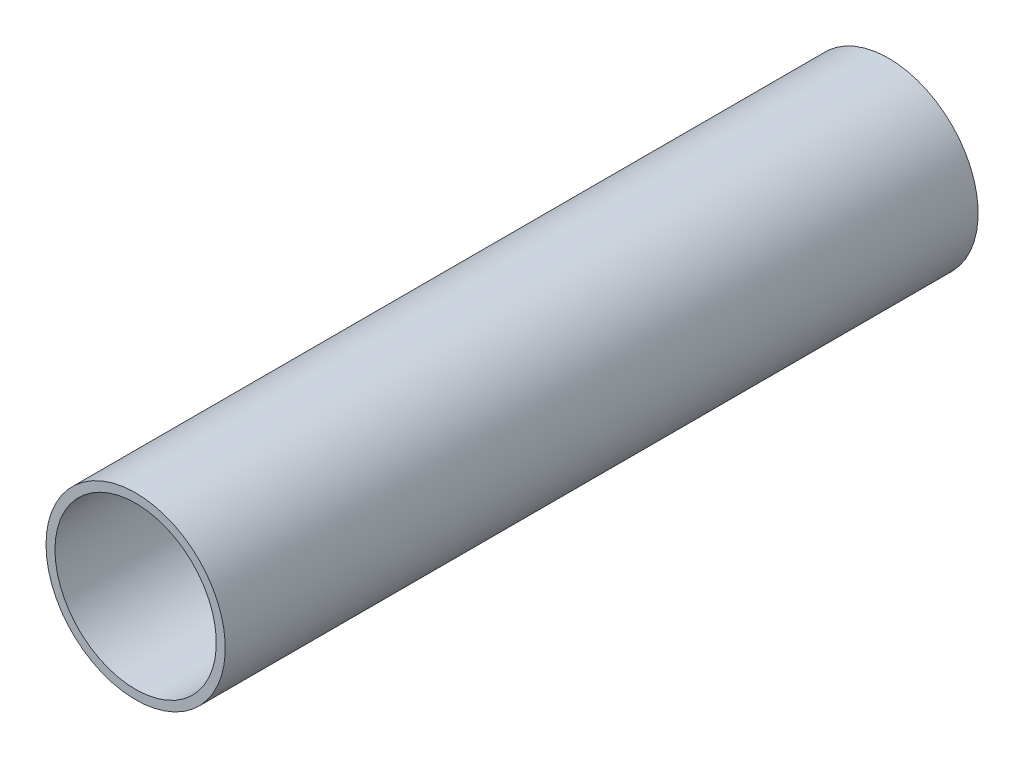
from build123d import *

# Parameters (mm, degrees)
ESQUISSE1_R        = 10
ESQUISSE1_R_2      = 9
BOSS_EXTRU_1_DEPTH = 84


with BuildPart() as part:
    # Esquisse1 → Boss.-Extru.1 (new body)
    with BuildSketch(Plane.XY):
        with Locations(Location((0, 0, 0), (0, 0, 180))):
            Circle(ESQUISSE1_R)
        with Locations(Location((0, 0, 0), (0, 0, 180))):
            Circle(ESQUISSE1_R_2, mode=Mode.SUBTRACT)
    extrude(amount=BOSS_EXTRU_1_DEPTH)


solid = part.part
